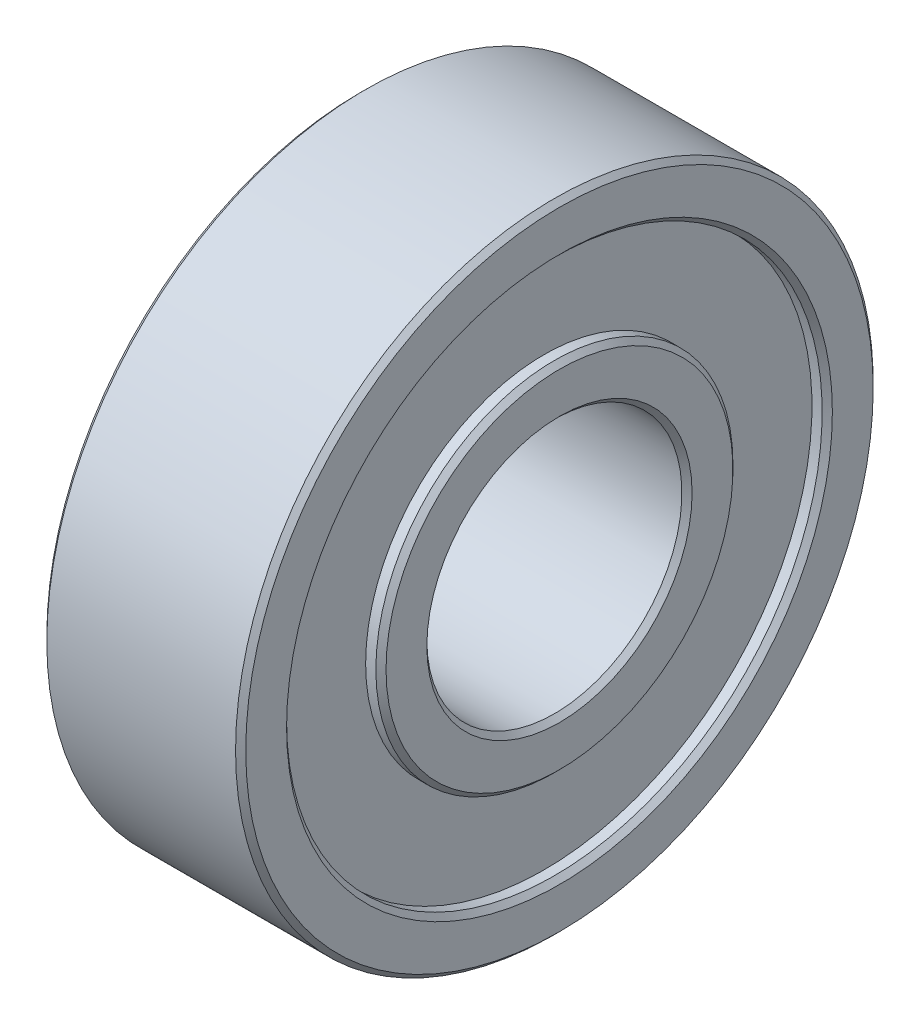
ISO-10303-21;
HEADER;
FILE_DESCRIPTION(('STEP AP214'),'2;1');
FILE_NAME('part.step','',(''),(''),'','','');
FILE_SCHEMA(('AUTOMOTIVE_DESIGN { 1 0 10303 214 1 1 1 1 }'));
ENDSEC;
DATA;
#1=APPLICATION_CONTEXT('core data for automotive mechanical design processes');
#2=APPLICATION_PROTOCOL_DEFINITION('international standard','automotive_design',2000,#1);
#3=PRODUCT_CONTEXT('',#1,'mechanical');
#4=PRODUCT('Part','Part','',(#3));
#5=PRODUCT_RELATED_PRODUCT_CATEGORY('part','',(#4));
#6=PRODUCT_DEFINITION_FORMATION('','',#4);
#7=PRODUCT_DEFINITION_CONTEXT('part definition',#1,'design');
#8=PRODUCT_DEFINITION('design','',#6,#7);
#9=PRODUCT_DEFINITION_SHAPE('','',#8);
#10=(LENGTH_UNIT() NAMED_UNIT(*) SI_UNIT(.MILLI.,.METRE.));
#11=(NAMED_UNIT(*) PLANE_ANGLE_UNIT() SI_UNIT($,.RADIAN.));
#12=(NAMED_UNIT(*) SI_UNIT($,.STERADIAN.) SOLID_ANGLE_UNIT());
#13=UNCERTAINTY_MEASURE_WITH_UNIT(LENGTH_MEASURE(1.E-05),#10,'distance_accuracy_value','');
#14=(GEOMETRIC_REPRESENTATION_CONTEXT(3) GLOBAL_UNCERTAINTY_ASSIGNED_CONTEXT((#13)) GLOBAL_UNIT_ASSIGNED_CONTEXT((#10,
#11,#12)) REPRESENTATION_CONTEXT('',''));
#15=CARTESIAN_POINT('',(0.,0.,0.));
#16=DIRECTION('',(0.,0.,1.));
#17=DIRECTION('',(1.,0.,0.));
#18=AXIS2_PLACEMENT_3D('',#15,#16,#17);
#19=CARTESIAN_POINT('',(0.126999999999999,0.,0.));
#20=DIRECTION('',(1.,0.,0.));
#21=DIRECTION('',(0.,0.,-1.));
#22=AXIS2_PLACEMENT_3D('',#19,#20,#21);
#23=CONICAL_SURFACE('',#22,7.9375,0.785398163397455);
#24=CARTESIAN_POINT('',(0.,0.,0.));
#25=DIRECTION('',(-1.,0.,0.));
#26=DIRECTION('',(0.,0.,1.));
#27=AXIS2_PLACEMENT_3D('',#24,#25,#26);
#28=CIRCLE('',#27,7.8105);
#29=CARTESIAN_POINT('',(0.,0.,7.8105));
#30=VERTEX_POINT('',#29);
#31=EDGE_CURVE('E10',#30,#30,#28,.T.);
#32=ORIENTED_EDGE('',*,*,#31,.F.);
#33=EDGE_LOOP('',(#32));
#34=FACE_BOUND('',#33,.T.);
#35=CARTESIAN_POINT('',(0.126999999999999,0.,0.));
#36=DIRECTION('',(-1.,0.,0.));
#37=DIRECTION('',(0.,0.,1.));
#38=AXIS2_PLACEMENT_3D('',#35,#36,#37);
#39=CIRCLE('',#38,7.9375);
#40=CARTESIAN_POINT('',(0.126999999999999,0.,7.9375));
#41=VERTEX_POINT('',#40);
#42=EDGE_CURVE('E94',#41,#41,#39,.T.);
#43=ORIENTED_EDGE('',*,*,#42,.T.);
#44=EDGE_LOOP('',(#43));
#45=FACE_BOUND('',#44,.T.);
#46=ADVANCED_FACE('F30',(#34,#45),#23,.T.);
#47=CARTESIAN_POINT('',(0.,0.,-7.8105));
#48=DIRECTION('',(1.,0.,0.));
#49=DIRECTION('',(0.,0.,-1.));
#50=AXIS2_PLACEMENT_3D('',#47,#48,#49);
#51=PLANE('',#50);
#52=CARTESIAN_POINT('',(0.,0.,0.));
#53=DIRECTION('',(-1.,0.,0.));
#54=DIRECTION('',(0.,0.,1.));
#55=AXIS2_PLACEMENT_3D('',#52,#53,#54);
#56=CIRCLE('',#55,6.7945);
#57=CARTESIAN_POINT('',(0.,0.,6.7945));
#58=VERTEX_POINT('',#57);
#59=EDGE_CURVE('E36',#58,#58,#56,.T.);
#60=ORIENTED_EDGE('',*,*,#59,.F.);
#61=EDGE_LOOP('',(#60));
#62=FACE_BOUND('',#61,.T.);
#63=ORIENTED_EDGE('',*,*,#31,.T.);
#64=EDGE_LOOP('',(#63));
#65=FACE_BOUND('',#64,.T.);
#66=ADVANCED_FACE('F203',(#62,#65),#51,.F.);
#67=CARTESIAN_POINT('',(0.,0.,0.));
#68=DIRECTION('',(-1.,0.,0.));
#69=DIRECTION('',(0.,0.,1.));
#70=AXIS2_PLACEMENT_3D('',#67,#68,#69);
#71=CONICAL_SURFACE('',#70,6.7945,0.785398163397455);
#72=CARTESIAN_POINT('',(0.126999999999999,0.,0.));
#73=DIRECTION('',(-1.,0.,0.));
#74=DIRECTION('',(0.,0.,1.));
#75=AXIS2_PLACEMENT_3D('',#72,#73,#74);
#76=CIRCLE('',#75,6.6675);
#77=CARTESIAN_POINT('',(0.126999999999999,0.,6.6675));
#78=VERTEX_POINT('',#77);
#79=EDGE_CURVE('E40',#78,#78,#76,.T.);
#80=ORIENTED_EDGE('',*,*,#79,.F.);
#81=EDGE_LOOP('',(#80));
#82=FACE_BOUND('',#81,.T.);
#83=ORIENTED_EDGE('',*,*,#59,.T.);
#84=EDGE_LOOP('',(#83));
#85=FACE_BOUND('',#84,.T.);
#86=ADVANCED_FACE('F198',(#82,#85),#71,.F.);
#87=CARTESIAN_POINT('',(-29.0787167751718,0.,0.));
#88=DIRECTION('',(-1.,0.,0.));
#89=DIRECTION('',(0.,0.,1.));
#90=AXIS2_PLACEMENT_3D('',#87,#88,#89);
#91=CYLINDRICAL_SURFACE('',#90,6.6675);
#92=CARTESIAN_POINT('',(0.380999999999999,0.,0.));
#93=DIRECTION('',(-1.,0.,0.));
#94=DIRECTION('',(0.,0.,1.));
#95=AXIS2_PLACEMENT_3D('',#92,#93,#94);
#96=CIRCLE('',#95,6.6675);
#97=CARTESIAN_POINT('',(0.380999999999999,0.,6.6675));
#98=VERTEX_POINT('',#97);
#99=EDGE_CURVE('E44',#98,#98,#96,.T.);
#100=ORIENTED_EDGE('',*,*,#99,.F.);
#101=EDGE_LOOP('',(#100));
#102=FACE_BOUND('',#101,.T.);
#103=ORIENTED_EDGE('',*,*,#79,.T.);
#104=EDGE_LOOP('',(#103));
#105=FACE_BOUND('',#104,.T.);
#106=ADVANCED_FACE('F192',(#102,#105),#91,.F.);
#107=CARTESIAN_POINT('',(0.381,0.,-6.6675));
#108=DIRECTION('',(1.,0.,0.));
#109=DIRECTION('',(0.,0.,-1.));
#110=AXIS2_PLACEMENT_3D('',#107,#108,#109);
#111=PLANE('',#110);
#112=CARTESIAN_POINT('',(0.380999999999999,0.,0.));
#113=DIRECTION('',(-1.,0.,0.));
#114=DIRECTION('',(0.,0.,1.));
#115=AXIS2_PLACEMENT_3D('',#112,#113,#114);
#116=CIRCLE('',#115,4.445);
#117=CARTESIAN_POINT('',(0.380999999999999,0.,4.445));
#118=VERTEX_POINT('',#117);
#119=EDGE_CURVE('E49',#118,#118,#116,.T.);
#120=ORIENTED_EDGE('',*,*,#119,.F.);
#121=EDGE_LOOP('',(#120));
#122=FACE_BOUND('',#121,.T.);
#123=ORIENTED_EDGE('',*,*,#99,.T.);
#124=EDGE_LOOP('',(#123));
#125=FACE_BOUND('',#124,.T.);
#126=ADVANCED_FACE('F186',(#122,#125),#111,.F.);
#127=CARTESIAN_POINT('',(-29.0787167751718,0.,0.));
#128=DIRECTION('',(-1.,0.,0.));
#129=DIRECTION('',(0.,0.,1.));
#130=AXIS2_PLACEMENT_3D('',#127,#128,#129);
#131=CYLINDRICAL_SURFACE('',#130,4.445);
#132=CARTESIAN_POINT('',(0.126999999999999,0.,0.));
#133=DIRECTION('',(-1.,0.,0.));
#134=DIRECTION('',(0.,0.,1.));
#135=AXIS2_PLACEMENT_3D('',#132,#133,#134);
#136=CIRCLE('',#135,4.445);
#137=CARTESIAN_POINT('',(0.126999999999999,0.,4.445));
#138=VERTEX_POINT('',#137);
#139=EDGE_CURVE('E52',#138,#138,#136,.T.);
#140=ORIENTED_EDGE('',*,*,#139,.F.);
#141=EDGE_LOOP('',(#140));
#142=FACE_BOUND('',#141,.T.);
#143=ORIENTED_EDGE('',*,*,#119,.T.);
#144=EDGE_LOOP('',(#143));
#145=FACE_BOUND('',#144,.T.);
#146=ADVANCED_FACE('F180',(#142,#145),#131,.T.);
#147=CARTESIAN_POINT('',(0.126999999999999,0.,0.));
#148=DIRECTION('',(1.,0.,0.));
#149=DIRECTION('',(0.,0.,-1.));
#150=AXIS2_PLACEMENT_3D('',#147,#148,#149);
#151=CONICAL_SURFACE('',#150,4.445,0.785398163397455);
#152=CARTESIAN_POINT('',(0.,0.,0.));
#153=DIRECTION('',(-1.,0.,0.));
#154=DIRECTION('',(0.,0.,1.));
#155=AXIS2_PLACEMENT_3D('',#152,#153,#154);
#156=CIRCLE('',#155,4.318);
#157=CARTESIAN_POINT('',(0.,0.,4.318));
#158=VERTEX_POINT('',#157);
#159=EDGE_CURVE('E55',#158,#158,#156,.T.);
#160=ORIENTED_EDGE('',*,*,#159,.F.);
#161=EDGE_LOOP('',(#160));
#162=FACE_BOUND('',#161,.T.);
#163=ORIENTED_EDGE('',*,*,#139,.T.);
#164=EDGE_LOOP('',(#163));
#165=FACE_BOUND('',#164,.T.);
#166=ADVANCED_FACE('F174',(#162,#165),#151,.T.);
#167=CARTESIAN_POINT('',(0.,0.,-4.318));
#168=DIRECTION('',(1.,0.,0.));
#169=DIRECTION('',(0.,0.,-1.));
#170=AXIS2_PLACEMENT_3D('',#167,#168,#169);
#171=PLANE('',#170);
#172=CARTESIAN_POINT('',(0.,0.,0.));
#173=DIRECTION('',(-1.,0.,0.));
#174=DIRECTION('',(0.,0.,1.));
#175=AXIS2_PLACEMENT_3D('',#172,#173,#174);
#176=CIRCLE('',#175,3.302);
#177=CARTESIAN_POINT('',(0.,0.,3.302));
#178=VERTEX_POINT('',#177);
#179=EDGE_CURVE('E58',#178,#178,#176,.T.);
#180=ORIENTED_EDGE('',*,*,#179,.F.);
#181=EDGE_LOOP('',(#180));
#182=FACE_BOUND('',#181,.T.);
#183=ORIENTED_EDGE('',*,*,#159,.T.);
#184=EDGE_LOOP('',(#183));
#185=FACE_BOUND('',#184,.T.);
#186=ADVANCED_FACE('F168',(#182,#185),#171,.F.);
#187=CARTESIAN_POINT('',(0.,0.,0.));
#188=DIRECTION('',(-1.,0.,0.));
#189=DIRECTION('',(0.,0.,1.));
#190=AXIS2_PLACEMENT_3D('',#187,#188,#189);
#191=CONICAL_SURFACE('',#190,3.302,0.785398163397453);
#192=CARTESIAN_POINT('',(0.126999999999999,0.,0.));
#193=DIRECTION('',(-1.,0.,0.));
#194=DIRECTION('',(0.,0.,1.));
#195=AXIS2_PLACEMENT_3D('',#192,#193,#194);
#196=CIRCLE('',#195,3.175);
#197=CARTESIAN_POINT('',(0.126999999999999,0.,3.175));
#198=VERTEX_POINT('',#197);
#199=EDGE_CURVE('E61',#198,#198,#196,.T.);
#200=ORIENTED_EDGE('',*,*,#199,.F.);
#201=EDGE_LOOP('',(#200));
#202=FACE_BOUND('',#201,.T.);
#203=ORIENTED_EDGE('',*,*,#179,.T.);
#204=EDGE_LOOP('',(#203));
#205=FACE_BOUND('',#204,.T.);
#206=ADVANCED_FACE('F162',(#202,#205),#191,.F.);
#207=CARTESIAN_POINT('',(-29.0787167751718,0.,0.));
#208=DIRECTION('',(-1.,0.,0.));
#209=DIRECTION('',(0.,0.,1.));
#210=AXIS2_PLACEMENT_3D('',#207,#208,#209);
#211=CYLINDRICAL_SURFACE('',#210,3.175);
#212=CARTESIAN_POINT('',(4.826,0.,0.));
#213=DIRECTION('',(-1.,0.,0.));
#214=DIRECTION('',(0.,0.,1.));
#215=AXIS2_PLACEMENT_3D('',#212,#213,#214);
#216=CIRCLE('',#215,3.175);
#217=CARTESIAN_POINT('',(4.826,0.,3.175));
#218=VERTEX_POINT('',#217);
#219=EDGE_CURVE('E64',#218,#218,#216,.T.);
#220=ORIENTED_EDGE('',*,*,#219,.F.);
#221=EDGE_LOOP('',(#220));
#222=FACE_BOUND('',#221,.T.);
#223=ORIENTED_EDGE('',*,*,#199,.T.);
#224=EDGE_LOOP('',(#223));
#225=FACE_BOUND('',#224,.T.);
#226=ADVANCED_FACE('F156',(#222,#225),#211,.F.);
#227=CARTESIAN_POINT('',(4.826,0.,0.));
#228=DIRECTION('',(1.,0.,0.));
#229=DIRECTION('',(0.,0.,-1.));
#230=AXIS2_PLACEMENT_3D('',#227,#228,#229);
#231=CONICAL_SURFACE('',#230,3.175,0.78539816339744);
#232=CARTESIAN_POINT('',(4.953,0.,0.));
#233=DIRECTION('',(-1.,0.,0.));
#234=DIRECTION('',(0.,0.,1.));
#235=AXIS2_PLACEMENT_3D('',#232,#233,#234);
#236=CIRCLE('',#235,3.302);
#237=CARTESIAN_POINT('',(4.953,0.,3.302));
#238=VERTEX_POINT('',#237);
#239=EDGE_CURVE('E67',#238,#238,#236,.T.);
#240=ORIENTED_EDGE('',*,*,#239,.F.);
#241=EDGE_LOOP('',(#240));
#242=FACE_BOUND('',#241,.T.);
#243=ORIENTED_EDGE('',*,*,#219,.T.);
#244=EDGE_LOOP('',(#243));
#245=FACE_BOUND('',#244,.T.);
#246=ADVANCED_FACE('F150',(#242,#245),#231,.F.);
#247=CARTESIAN_POINT('',(4.953,0.,-3.302));
#248=DIRECTION('',(-1.,0.,0.));
#249=DIRECTION('',(0.,0.,1.));
#250=AXIS2_PLACEMENT_3D('',#247,#248,#249);
#251=PLANE('',#250);
#252=CARTESIAN_POINT('',(4.953,0.,0.));
#253=DIRECTION('',(-1.,0.,0.));
#254=DIRECTION('',(0.,0.,1.));
#255=AXIS2_PLACEMENT_3D('',#252,#253,#254);
#256=CIRCLE('',#255,4.318);
#257=CARTESIAN_POINT('',(4.953,0.,4.318));
#258=VERTEX_POINT('',#257);
#259=EDGE_CURVE('E70',#258,#258,#256,.T.);
#260=ORIENTED_EDGE('',*,*,#259,.F.);
#261=EDGE_LOOP('',(#260));
#262=FACE_BOUND('',#261,.T.);
#263=ORIENTED_EDGE('',*,*,#239,.T.);
#264=EDGE_LOOP('',(#263));
#265=FACE_BOUND('',#264,.T.);
#266=ADVANCED_FACE('F144',(#262,#265),#251,.F.);
#267=CARTESIAN_POINT('',(4.953,0.,0.));
#268=DIRECTION('',(-1.,0.,0.));
#269=DIRECTION('',(0.,0.,1.));
#270=AXIS2_PLACEMENT_3D('',#267,#268,#269);
#271=CONICAL_SURFACE('',#270,4.318,0.785398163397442);
#272=CARTESIAN_POINT('',(4.826,0.,0.));
#273=DIRECTION('',(-1.,0.,0.));
#274=DIRECTION('',(0.,0.,1.));
#275=AXIS2_PLACEMENT_3D('',#272,#273,#274);
#276=CIRCLE('',#275,4.445);
#277=CARTESIAN_POINT('',(4.826,0.,4.445));
#278=VERTEX_POINT('',#277);
#279=EDGE_CURVE('E73',#278,#278,#276,.T.);
#280=ORIENTED_EDGE('',*,*,#279,.F.);
#281=EDGE_LOOP('',(#280));
#282=FACE_BOUND('',#281,.T.);
#283=ORIENTED_EDGE('',*,*,#259,.T.);
#284=EDGE_LOOP('',(#283));
#285=FACE_BOUND('',#284,.T.);
#286=ADVANCED_FACE('F138',(#282,#285),#271,.T.);
#287=CARTESIAN_POINT('',(-29.0787167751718,0.,0.));
#288=DIRECTION('',(-1.,0.,0.));
#289=DIRECTION('',(0.,0.,1.));
#290=AXIS2_PLACEMENT_3D('',#287,#288,#289);
#291=CYLINDRICAL_SURFACE('',#290,4.445);
#292=CARTESIAN_POINT('',(4.572,0.,0.));
#293=DIRECTION('',(-1.,0.,0.));
#294=DIRECTION('',(0.,0.,1.));
#295=AXIS2_PLACEMENT_3D('',#292,#293,#294);
#296=CIRCLE('',#295,4.445);
#297=CARTESIAN_POINT('',(4.572,0.,4.445));
#298=VERTEX_POINT('',#297);
#299=EDGE_CURVE('E76',#298,#298,#296,.T.);
#300=ORIENTED_EDGE('',*,*,#299,.F.);
#301=EDGE_LOOP('',(#300));
#302=FACE_BOUND('',#301,.T.);
#303=ORIENTED_EDGE('',*,*,#279,.T.);
#304=EDGE_LOOP('',(#303));
#305=FACE_BOUND('',#304,.T.);
#306=ADVANCED_FACE('F132',(#302,#305),#291,.T.);
#307=CARTESIAN_POINT('',(4.572,0.,-4.445));
#308=DIRECTION('',(-1.,0.,0.));
#309=DIRECTION('',(0.,0.,1.));
#310=AXIS2_PLACEMENT_3D('',#307,#308,#309);
#311=PLANE('',#310);
#312=CARTESIAN_POINT('',(4.572,0.,0.));
#313=DIRECTION('',(-1.,0.,0.));
#314=DIRECTION('',(0.,0.,1.));
#315=AXIS2_PLACEMENT_3D('',#312,#313,#314);
#316=CIRCLE('',#315,6.6675);
#317=CARTESIAN_POINT('',(4.572,0.,6.6675));
#318=VERTEX_POINT('',#317);
#319=EDGE_CURVE('E79',#318,#318,#316,.T.);
#320=ORIENTED_EDGE('',*,*,#319,.F.);
#321=EDGE_LOOP('',(#320));
#322=FACE_BOUND('',#321,.T.);
#323=ORIENTED_EDGE('',*,*,#299,.T.);
#324=EDGE_LOOP('',(#323));
#325=FACE_BOUND('',#324,.T.);
#326=ADVANCED_FACE('F126',(#322,#325),#311,.F.);
#327=CARTESIAN_POINT('',(-29.0787167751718,0.,0.));
#328=DIRECTION('',(-1.,0.,0.));
#329=DIRECTION('',(0.,0.,1.));
#330=AXIS2_PLACEMENT_3D('',#327,#328,#329);
#331=CYLINDRICAL_SURFACE('',#330,6.6675);
#332=CARTESIAN_POINT('',(4.826,0.,0.));
#333=DIRECTION('',(-1.,0.,0.));
#334=DIRECTION('',(0.,0.,1.));
#335=AXIS2_PLACEMENT_3D('',#332,#333,#334);
#336=CIRCLE('',#335,6.6675);
#337=CARTESIAN_POINT('',(4.826,0.,6.6675));
#338=VERTEX_POINT('',#337);
#339=EDGE_CURVE('E82',#338,#338,#336,.T.);
#340=ORIENTED_EDGE('',*,*,#339,.F.);
#341=EDGE_LOOP('',(#340));
#342=FACE_BOUND('',#341,.T.);
#343=ORIENTED_EDGE('',*,*,#319,.T.);
#344=EDGE_LOOP('',(#343));
#345=FACE_BOUND('',#344,.T.);
#346=ADVANCED_FACE('F120',(#342,#345),#331,.F.);
#347=CARTESIAN_POINT('',(4.826,0.,0.));
#348=DIRECTION('',(1.,0.,0.));
#349=DIRECTION('',(0.,0.,-1.));
#350=AXIS2_PLACEMENT_3D('',#347,#348,#349);
#351=CONICAL_SURFACE('',#350,6.6675,0.785398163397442);
#352=CARTESIAN_POINT('',(4.953,0.,0.));
#353=DIRECTION('',(-1.,0.,0.));
#354=DIRECTION('',(0.,0.,1.));
#355=AXIS2_PLACEMENT_3D('',#352,#353,#354);
#356=CIRCLE('',#355,6.7945);
#357=CARTESIAN_POINT('',(4.953,0.,6.7945));
#358=VERTEX_POINT('',#357);
#359=EDGE_CURVE('E85',#358,#358,#356,.T.);
#360=ORIENTED_EDGE('',*,*,#359,.F.);
#361=EDGE_LOOP('',(#360));
#362=FACE_BOUND('',#361,.T.);
#363=ORIENTED_EDGE('',*,*,#339,.T.);
#364=EDGE_LOOP('',(#363));
#365=FACE_BOUND('',#364,.T.);
#366=ADVANCED_FACE('F114',(#362,#365),#351,.F.);
#367=CARTESIAN_POINT('',(4.953,0.,-6.7945));
#368=DIRECTION('',(-1.,0.,0.));
#369=DIRECTION('',(0.,0.,1.));
#370=AXIS2_PLACEMENT_3D('',#367,#368,#369);
#371=PLANE('',#370);
#372=CARTESIAN_POINT('',(4.953,0.,0.));
#373=DIRECTION('',(-1.,0.,0.));
#374=DIRECTION('',(0.,0.,1.));
#375=AXIS2_PLACEMENT_3D('',#372,#373,#374);
#376=CIRCLE('',#375,7.8105);
#377=CARTESIAN_POINT('',(4.953,0.,7.8105));
#378=VERTEX_POINT('',#377);
#379=EDGE_CURVE('E88',#378,#378,#376,.T.);
#380=ORIENTED_EDGE('',*,*,#379,.F.);
#381=EDGE_LOOP('',(#380));
#382=FACE_BOUND('',#381,.T.);
#383=ORIENTED_EDGE('',*,*,#359,.T.);
#384=EDGE_LOOP('',(#383));
#385=FACE_BOUND('',#384,.T.);
#386=ADVANCED_FACE('F108',(#382,#385),#371,.F.);
#387=CARTESIAN_POINT('',(4.953,0.,0.));
#388=DIRECTION('',(-1.,0.,0.));
#389=DIRECTION('',(0.,0.,1.));
#390=AXIS2_PLACEMENT_3D('',#387,#388,#389);
#391=CONICAL_SURFACE('',#390,7.8105,0.785398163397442);
#392=CARTESIAN_POINT('',(4.826,0.,0.));
#393=DIRECTION('',(-1.,0.,0.));
#394=DIRECTION('',(0.,0.,1.));
#395=AXIS2_PLACEMENT_3D('',#392,#393,#394);
#396=CIRCLE('',#395,7.9375);
#397=CARTESIAN_POINT('',(4.826,0.,7.9375));
#398=VERTEX_POINT('',#397);
#399=EDGE_CURVE('E91',#398,#398,#396,.T.);
#400=ORIENTED_EDGE('',*,*,#399,.F.);
#401=EDGE_LOOP('',(#400));
#402=FACE_BOUND('',#401,.T.);
#403=ORIENTED_EDGE('',*,*,#379,.T.);
#404=EDGE_LOOP('',(#403));
#405=FACE_BOUND('',#404,.T.);
#406=ADVANCED_FACE('F102',(#402,#405),#391,.T.);
#407=CARTESIAN_POINT('',(-29.0787167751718,0.,0.));
#408=DIRECTION('',(-1.,0.,0.));
#409=DIRECTION('',(0.,0.,1.));
#410=AXIS2_PLACEMENT_3D('',#407,#408,#409);
#411=CYLINDRICAL_SURFACE('',#410,7.9375);
#412=ORIENTED_EDGE('',*,*,#42,.F.);
#413=EDGE_LOOP('',(#412));
#414=FACE_BOUND('',#413,.T.);
#415=ORIENTED_EDGE('',*,*,#399,.T.);
#416=EDGE_LOOP('',(#415));
#417=FACE_BOUND('',#416,.T.);
#418=ADVANCED_FACE('F99',(#414,#417),#411,.T.);
#419=CLOSED_SHELL('',(#46,#66,#86,#106,#126,#146,#166,#186,#206,#226,#246,#266,#286,#306,#326,
#346,#366,#386,#406,#418));
#420=MANIFOLD_SOLID_BREP('B2',#419);
#421=ADVANCED_BREP_SHAPE_REPRESENTATION('',(#18,#420),#14);
#422=SHAPE_DEFINITION_REPRESENTATION(#9,#421);
ENDSEC;
END-ISO-10303-21;
